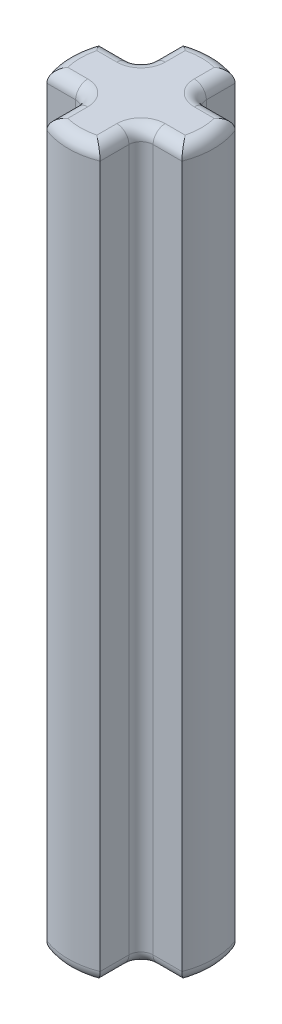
from build123d import *

# Parameters (mm, degrees)
BOSS_EXTRUDE1_DEPTH = 24
FILLET7_R           = 0.4


with BuildPart() as part:
    # Sketch1 → Boss-Extrude1 (new body)
    with BuildSketch(Plane(origin=(0, 0, 0), x_dir=(1, 0, 0), z_dir=(0, 1, 0))):
        with BuildLine():
            Line((-2.232845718, 0.88), (-0.88, 0.88))
            Line((-0.88, 0.88), (-0.88, 2.232845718))
            ThreePointArc((-0.88, 2.232845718), (0, 2.4), (0.88, 2.232845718))
            Line((0.88, 2.232845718), (0.88, 0.88))
            Line((0.88, 0.88), (2.232845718, 0.88))
            ThreePointArc((2.232845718, 0.88), (2.4, 0), (2.232845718, -0.88))
            Line((2.232845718, -0.88), (0.88, -0.88))
            Line((0.88, -0.88), (0.88, -2.232845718))
            ThreePointArc((0.88, -2.232845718), (0, -2.4), (-0.88, -2.232845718))
            Line((-0.88, -2.232845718), (-0.88, -0.88))
            Line((-0.88, -0.88), (-2.232845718, -0.88))
            ThreePointArc((-2.232845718, -0.88), (-2.4, 0), (-2.232845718, 0.88))
        make_face()
    extrude(amount=BOSS_EXTRUDE1_DEPTH)

    # Fillet7
    fillet7_edges = [part.edges().sort_by_distance(p)[0] for p in [
        (-2.4, 24, 0),
        (0, 0, -2.4),
        (0.88, 0, -1.556422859),
        (1.556422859, 0, -0.88),
        (2.4, 0, 0),
        (1.556422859, 0, 0.88),
        (0.88, 0, 1.556422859),
        (-1.556422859, 24, 0.88),
        (0, 0, 2.4),
        (-0.88, 0, 1.556422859),
        (-1.556422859, 0, 0.88),
        (-2.4, 0, 0),
        (-1.556422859, 0, -0.88),
        (-0.88, 0, -1.556422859),
        (-0.88, 24, 1.556422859),
        (0, 24, 2.4),
        (0.88, 12, -0.88),
        (0.88, 12, 0.88),
        (-0.88, 12, 0.88),
        (-0.88, 12, -0.88),
        (0.88, 24, 1.556422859),
        (1.556422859, 24, 0.88),
        (2.4, 24, 0),
        (1.556422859, 24, -0.88),
        (0.88, 24, -1.556422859),
        (0, 24, -2.4),
        (-0.88, 24, -1.556422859),
        (-1.556422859, 24, -0.88),
    ]]
    fillet(fillet7_edges, radius=FILLET7_R)


solid = part.part
